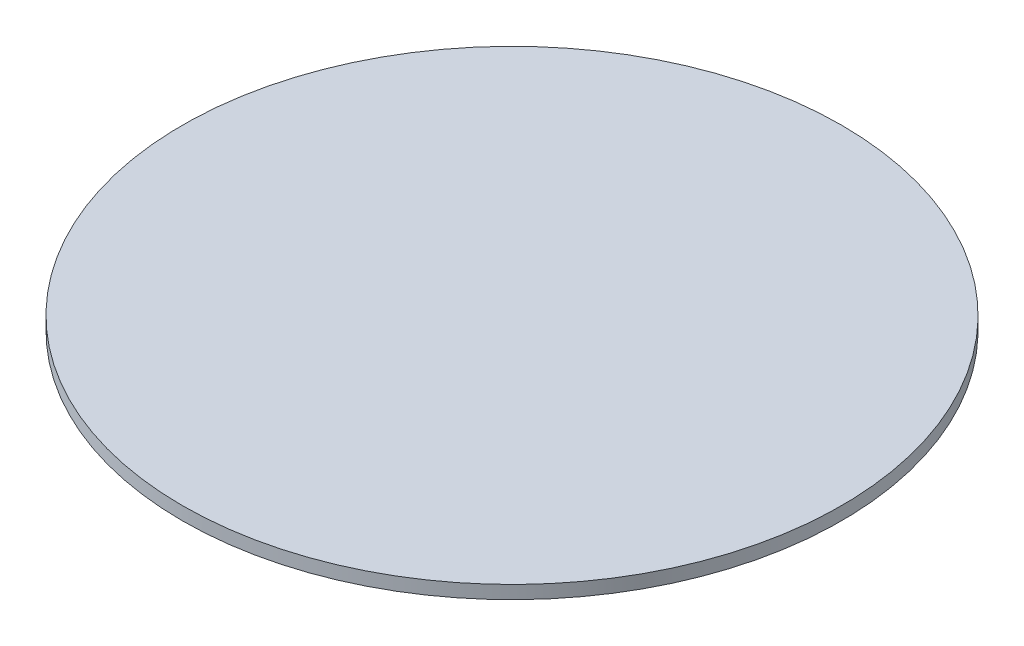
ISO-10303-21;
HEADER;
FILE_DESCRIPTION(('STEP AP214'),'2;1');
FILE_NAME('part.step','',(''),(''),'','','');
FILE_SCHEMA(('AUTOMOTIVE_DESIGN { 1 0 10303 214 1 1 1 1 }'));
ENDSEC;
DATA;
#1=APPLICATION_CONTEXT('core data for automotive mechanical design processes');
#2=APPLICATION_PROTOCOL_DEFINITION('international standard','automotive_design',2000,#1);
#3=PRODUCT_CONTEXT('',#1,'mechanical');
#4=PRODUCT('Part','Part','',(#3));
#5=PRODUCT_RELATED_PRODUCT_CATEGORY('part','',(#4));
#6=PRODUCT_DEFINITION_FORMATION('','',#4);
#7=PRODUCT_DEFINITION_CONTEXT('part definition',#1,'design');
#8=PRODUCT_DEFINITION('design','',#6,#7);
#9=PRODUCT_DEFINITION_SHAPE('','',#8);
#10=(LENGTH_UNIT() NAMED_UNIT(*) SI_UNIT(.MILLI.,.METRE.));
#11=(NAMED_UNIT(*) PLANE_ANGLE_UNIT() SI_UNIT($,.RADIAN.));
#12=(NAMED_UNIT(*) SI_UNIT($,.STERADIAN.) SOLID_ANGLE_UNIT());
#13=UNCERTAINTY_MEASURE_WITH_UNIT(LENGTH_MEASURE(1.E-05),#10,'distance_accuracy_value','');
#14=(GEOMETRIC_REPRESENTATION_CONTEXT(3) GLOBAL_UNCERTAINTY_ASSIGNED_CONTEXT((#13)) GLOBAL_UNIT_ASSIGNED_CONTEXT((#10,
#11,#12)) REPRESENTATION_CONTEXT('',''));
#15=CARTESIAN_POINT('',(0.,0.,0.));
#16=DIRECTION('',(0.,0.,1.));
#17=DIRECTION('',(1.,0.,0.));
#18=AXIS2_PLACEMENT_3D('',#15,#16,#17);
#19=CARTESIAN_POINT('',(0.,2.54,0.));
#20=DIRECTION('',(0.,-1.,0.));
#21=DIRECTION('',(0.,0.,-1.));
#22=AXIS2_PLACEMENT_3D('',#19,#20,#21);
#23=CYLINDRICAL_SURFACE('',#22,63.5);
#24=CARTESIAN_POINT('',(0.,2.54,0.));
#25=DIRECTION('',(0.,1.,0.));
#26=DIRECTION('',(0.,0.,1.));
#27=AXIS2_PLACEMENT_3D('',#24,#25,#26);
#28=CIRCLE('',#27,63.5);
#29=CARTESIAN_POINT('',(0.,2.54,63.5));
#30=VERTEX_POINT('',#29);
#31=EDGE_CURVE('E10',#30,#30,#28,.T.);
#32=ORIENTED_EDGE('',*,*,#31,.F.);
#33=EDGE_LOOP('',(#32));
#34=FACE_BOUND('',#33,.T.);
#35=CARTESIAN_POINT('',(0.,0.,0.));
#36=DIRECTION('',(0.,1.,0.));
#37=DIRECTION('',(0.,0.,1.));
#38=AXIS2_PLACEMENT_3D('',#35,#36,#37);
#39=CIRCLE('',#38,63.5);
#40=CARTESIAN_POINT('',(0.,0.,63.5));
#41=VERTEX_POINT('',#40);
#42=EDGE_CURVE('E34',#41,#41,#39,.T.);
#43=ORIENTED_EDGE('',*,*,#42,.T.);
#44=EDGE_LOOP('',(#43));
#45=FACE_BOUND('',#44,.T.);
#46=ADVANCED_FACE('F31',(#34,#45),#23,.T.);
#47=CARTESIAN_POINT('',(0.,2.54,0.));
#48=DIRECTION('',(0.,1.,0.));
#49=DIRECTION('',(0.,0.,1.));
#50=AXIS2_PLACEMENT_3D('',#47,#48,#49);
#51=PLANE('',#50);
#52=ORIENTED_EDGE('',*,*,#31,.T.);
#53=EDGE_LOOP('',(#52));
#54=FACE_BOUND('',#53,.T.);
#55=ADVANCED_FACE('F46',(#54),#51,.T.);
#56=CARTESIAN_POINT('',(0.,0.,0.));
#57=DIRECTION('',(0.,1.,0.));
#58=DIRECTION('',(0.,0.,1.));
#59=AXIS2_PLACEMENT_3D('',#56,#57,#58);
#60=PLANE('',#59);
#61=ORIENTED_EDGE('',*,*,#42,.F.);
#62=EDGE_LOOP('',(#61));
#63=FACE_BOUND('',#62,.T.);
#64=ADVANCED_FACE('F44',(#63),#60,.F.);
#65=CLOSED_SHELL('',(#46,#55,#64));
#66=MANIFOLD_SOLID_BREP('B2',#65);
#67=ADVANCED_BREP_SHAPE_REPRESENTATION('',(#18,#66),#14);
#68=SHAPE_DEFINITION_REPRESENTATION(#9,#67);
ENDSEC;
END-ISO-10303-21;
